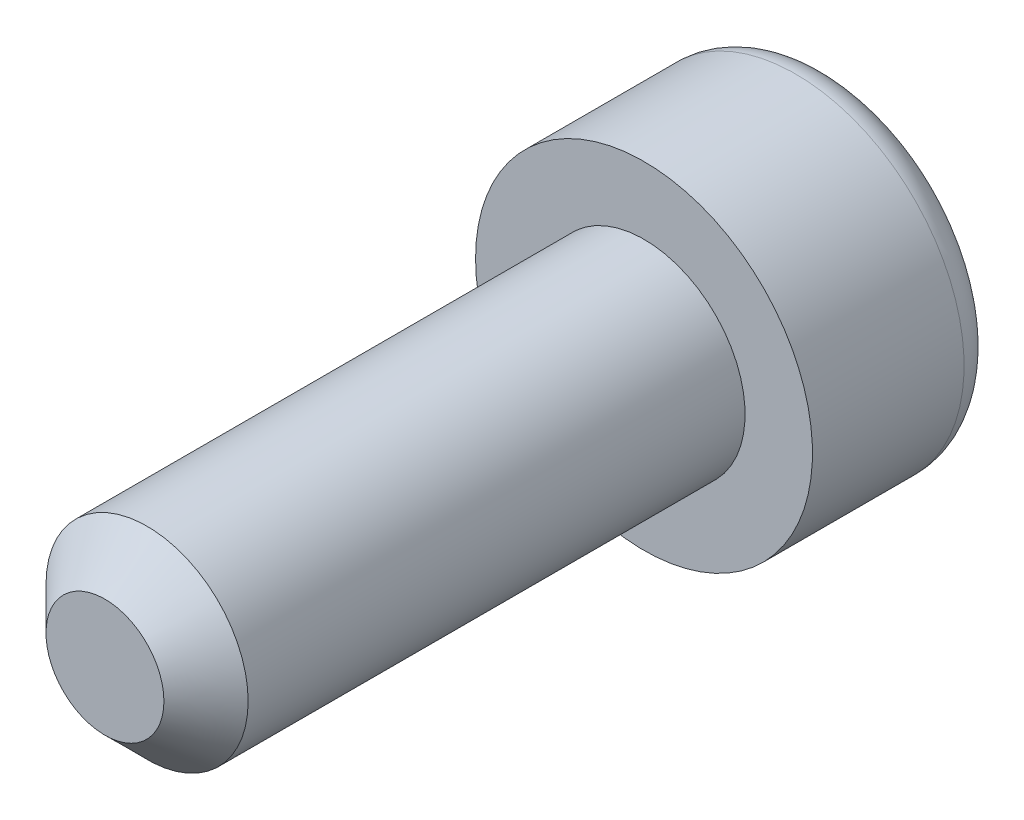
ISO-10303-21;
HEADER;
FILE_DESCRIPTION(('STEP AP214'),'2;1');
FILE_NAME('part.step','',(''),(''),'','','');
FILE_SCHEMA(('AUTOMOTIVE_DESIGN { 1 0 10303 214 1 1 1 1 }'));
ENDSEC;
DATA;
#1=APPLICATION_CONTEXT('core data for automotive mechanical design processes');
#2=APPLICATION_PROTOCOL_DEFINITION('international standard','automotive_design',2000,#1);
#3=PRODUCT_CONTEXT('',#1,'mechanical');
#4=PRODUCT('Part','Part','',(#3));
#5=PRODUCT_RELATED_PRODUCT_CATEGORY('part','',(#4));
#6=PRODUCT_DEFINITION_FORMATION('','',#4);
#7=PRODUCT_DEFINITION_CONTEXT('part definition',#1,'design');
#8=PRODUCT_DEFINITION('design','',#6,#7);
#9=PRODUCT_DEFINITION_SHAPE('','',#8);
#10=(LENGTH_UNIT() NAMED_UNIT(*) SI_UNIT(.MILLI.,.METRE.));
#11=(NAMED_UNIT(*) PLANE_ANGLE_UNIT() SI_UNIT($,.RADIAN.));
#12=(NAMED_UNIT(*) SI_UNIT($,.STERADIAN.) SOLID_ANGLE_UNIT());
#13=UNCERTAINTY_MEASURE_WITH_UNIT(LENGTH_MEASURE(1.E-05),#10,'distance_accuracy_value','');
#14=(GEOMETRIC_REPRESENTATION_CONTEXT(3) GLOBAL_UNCERTAINTY_ASSIGNED_CONTEXT((#13)) GLOBAL_UNIT_ASSIGNED_CONTEXT((#10,
#11,#12)) REPRESENTATION_CONTEXT('',''));
#15=CARTESIAN_POINT('',(0.,0.,0.));
#16=DIRECTION('',(0.,0.,1.));
#17=DIRECTION('',(1.,0.,0.));
#18=AXIS2_PLACEMENT_3D('',#15,#16,#17);
#19=CARTESIAN_POINT('',(0.,0.,16.));
#20=DIRECTION('',(0.,0.,-1.));
#21=DIRECTION('',(-1.,0.,0.));
#22=AXIS2_PLACEMENT_3D('',#19,#20,#21);
#23=CYLINDRICAL_SURFACE('',#22,3.);
#24=CARTESIAN_POINT('',(0.,0.,14.75));
#25=DIRECTION('',(0.,0.,1.));
#26=DIRECTION('',(1.,0.,0.));
#27=AXIS2_PLACEMENT_3D('',#24,#25,#26);
#28=CIRCLE('',#27,3.);
#29=CARTESIAN_POINT('',(3.,0.,14.75));
#30=VERTEX_POINT('',#29);
#31=EDGE_CURVE('E145',#30,#30,#28,.F.);
#32=ORIENTED_EDGE('',*,*,#31,.T.);
#33=EDGE_LOOP('',(#32));
#34=FACE_BOUND('',#33,.T.);
#35=CARTESIAN_POINT('',(0.,0.,0.));
#36=DIRECTION('',(0.,0.,-1.));
#37=DIRECTION('',(-1.,0.,0.));
#38=AXIS2_PLACEMENT_3D('',#35,#36,#37);
#39=CIRCLE('',#38,3.);
#40=CARTESIAN_POINT('',(-3.,0.,0.));
#41=VERTEX_POINT('',#40);
#42=EDGE_CURVE('E139',#41,#41,#39,.T.);
#43=ORIENTED_EDGE('',*,*,#42,.F.);
#44=EDGE_LOOP('',(#43));
#45=FACE_BOUND('',#44,.T.);
#46=ADVANCED_FACE('F28',(#34,#45),#23,.T.);
#47=CARTESIAN_POINT('',(0.,0.,16.));
#48=DIRECTION('',(0.,0.,1.));
#49=DIRECTION('',(1.,0.,0.));
#50=AXIS2_PLACEMENT_3D('',#47,#48,#49);
#51=PLANE('',#50);
#52=CARTESIAN_POINT('',(0.,0.,16.));
#53=DIRECTION('',(0.,0.,1.));
#54=DIRECTION('',(1.,0.,0.));
#55=AXIS2_PLACEMENT_3D('',#52,#53,#54);
#56=CIRCLE('',#55,1.75);
#57=CARTESIAN_POINT('',(1.74999999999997,0.,16.));
#58=VERTEX_POINT('',#57);
#59=EDGE_CURVE('E142',#58,#58,#56,.T.);
#60=ORIENTED_EDGE('',*,*,#59,.T.);
#61=EDGE_LOOP('',(#60));
#62=FACE_BOUND('',#61,.T.);
#63=ADVANCED_FACE('F167',(#62),#51,.T.);
#64=CARTESIAN_POINT('',(0.,0.,0.));
#65=DIRECTION('',(0.,0.,-1.));
#66=DIRECTION('',(-1.,0.,0.));
#67=AXIS2_PLACEMENT_3D('',#64,#65,#66);
#68=PLANE('',#67);
#69=CARTESIAN_POINT('',(0.,0.,0.));
#70=DIRECTION('',(0.,0.,-1.));
#71=DIRECTION('',(-1.,0.,0.));
#72=AXIS2_PLACEMENT_3D('',#69,#70,#71);
#73=CIRCLE('',#72,5.);
#74=CARTESIAN_POINT('',(-5.,0.,0.));
#75=VERTEX_POINT('',#74);
#76=EDGE_CURVE('E130',#75,#75,#73,.T.);
#77=ORIENTED_EDGE('',*,*,#76,.F.);
#78=EDGE_LOOP('',(#77));
#79=FACE_BOUND('',#78,.T.);
#80=ORIENTED_EDGE('',*,*,#42,.T.);
#81=EDGE_LOOP('',(#80));
#82=FACE_BOUND('',#81,.T.);
#83=ADVANCED_FACE('F172',(#79,#82),#68,.F.);
#84=CARTESIAN_POINT('',(0.,0.,-5.50000000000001));
#85=DIRECTION('',(0.,0.,1.));
#86=DIRECTION('',(1.,0.,0.));
#87=AXIS2_PLACEMENT_3D('',#84,#85,#86);
#88=CYLINDRICAL_SURFACE('',#87,5.);
#89=CARTESIAN_POINT('',(0.,0.,-4.5));
#90=DIRECTION('',(0.,0.,-1.));
#91=DIRECTION('',(-1.,0.,0.));
#92=AXIS2_PLACEMENT_3D('',#89,#90,#91);
#93=CIRCLE('',#92,5.);
#94=CARTESIAN_POINT('',(-5.,0.,-4.5));
#95=VERTEX_POINT('',#94);
#96=EDGE_CURVE('E11',#95,#95,#93,.F.);
#97=ORIENTED_EDGE('',*,*,#96,.T.);
#98=EDGE_LOOP('',(#97));
#99=FACE_BOUND('',#98,.T.);
#100=ORIENTED_EDGE('',*,*,#76,.T.);
#101=EDGE_LOOP('',(#100));
#102=FACE_BOUND('',#101,.T.);
#103=ADVANCED_FACE('F179',(#99,#102),#88,.T.);
#104=CARTESIAN_POINT('',(0.,0.,-5.50000000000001));
#105=DIRECTION('',(0.,0.,-1.));
#106=DIRECTION('',(-1.,0.,0.));
#107=AXIS2_PLACEMENT_3D('',#104,#105,#106);
#108=PLANE('',#107);
#109=DIRECTION('',(-0.977909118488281,-0.209030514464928,0.));
#110=VECTOR('',#109,1.);
#111=CARTESIAN_POINT('',(1.54725321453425,-1.71445058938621,-5.50000000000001));
#112=LINE('',#111,#110);
#113=CARTESIAN_POINT('',(1.54725321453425,-1.71445058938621,-5.50000000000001));
#114=VERTEX_POINT('',#113);
#115=CARTESIAN_POINT('',(-0.711131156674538,-2.19718588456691,-5.50000000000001));
#116=VERTEX_POINT('',#115);
#117=EDGE_CURVE('E42',#114,#116,#112,.T.);
#118=ORIENTED_EDGE('',*,*,#117,.F.);
#119=DIRECTION('',(-0.307928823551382,-0.951409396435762,0.));
#120=VECTOR('',#119,1.);
#121=CARTESIAN_POINT('',(2.25838437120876,0.482735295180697,-5.50000000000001));
#122=LINE('',#121,#120);
#123=CARTESIAN_POINT('',(2.25838437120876,0.482735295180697,-5.50000000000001));
#124=VERTEX_POINT('',#123);
#125=EDGE_CURVE('E112',#124,#114,#122,.T.);
#126=ORIENTED_EDGE('',*,*,#125,.F.);
#127=DIRECTION('',(0.669980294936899,-0.742378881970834,0.));
#128=VECTOR('',#127,1.);
#129=CARTESIAN_POINT('',(0.71113115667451,2.19718588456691,-5.50000000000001));
#130=LINE('',#129,#128);
#131=CARTESIAN_POINT('',(0.71113115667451,2.19718588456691,-5.50000000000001));
#132=VERTEX_POINT('',#131);
#133=EDGE_CURVE('E106',#132,#124,#130,.T.);
#134=ORIENTED_EDGE('',*,*,#133,.F.);
#135=DIRECTION('',(0.977909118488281,0.209030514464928,0.));
#136=VECTOR('',#135,1.);
#137=CARTESIAN_POINT('',(-1.54725321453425,1.71445058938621,-5.50000000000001));
#138=LINE('',#137,#136);
#139=CARTESIAN_POINT('',(-1.54725321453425,1.71445058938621,-5.50000000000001));
#140=VERTEX_POINT('',#139);
#141=EDGE_CURVE('E104',#140,#132,#138,.T.);
#142=ORIENTED_EDGE('',*,*,#141,.F.);
#143=DIRECTION('',(0.307928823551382,0.951409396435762,0.));
#144=VECTOR('',#143,1.);
#145=CARTESIAN_POINT('',(-2.25838437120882,-0.482735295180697,-5.50000000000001));
#146=LINE('',#145,#144);
#147=CARTESIAN_POINT('',(-2.25838437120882,-0.482735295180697,-5.50000000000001));
#148=VERTEX_POINT('',#147);
#149=EDGE_CURVE('E85',#148,#140,#146,.T.);
#150=ORIENTED_EDGE('',*,*,#149,.F.);
#151=DIRECTION('',(-0.669980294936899,0.742378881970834,0.));
#152=VECTOR('',#151,1.);
#153=CARTESIAN_POINT('',(-0.711131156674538,-2.19718588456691,-5.50000000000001));
#154=LINE('',#153,#152);
#155=EDGE_CURVE('E96',#116,#148,#154,.T.);
#156=ORIENTED_EDGE('',*,*,#155,.F.);
#157=EDGE_LOOP('',(#118,#126,#134,#142,#150,#156));
#158=FACE_BOUND('',#157,.T.);
#159=CARTESIAN_POINT('',(0.,0.,-5.50000000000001));
#160=DIRECTION('',(0.,0.,-1.));
#161=DIRECTION('',(-1.,0.,0.));
#162=AXIS2_PLACEMENT_3D('',#159,#160,#161);
#163=CIRCLE('',#162,4.);
#164=CARTESIAN_POINT('',(-4.,0.,-5.50000000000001));
#165=VERTEX_POINT('',#164);
#166=EDGE_CURVE('E35',#165,#165,#163,.T.);
#167=ORIENTED_EDGE('',*,*,#166,.T.);
#168=EDGE_LOOP('',(#167));
#169=FACE_BOUND('',#168,.T.);
#170=ADVANCED_FACE('F100',(#158,#169),#108,.T.);
#171=CARTESIAN_POINT('',(0.,0.,16.));
#172=DIRECTION('',(0.,0.,-1.));
#173=DIRECTION('',(-1.,0.,0.));
#174=AXIS2_PLACEMENT_3D('',#171,#172,#173);
#175=CONICAL_SURFACE('',#174,1.75,0.785398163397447);
#176=ORIENTED_EDGE('',*,*,#31,.F.);
#177=EDGE_LOOP('',(#176));
#178=FACE_BOUND('',#177,.T.);
#179=ORIENTED_EDGE('',*,*,#59,.F.);
#180=EDGE_LOOP('',(#179));
#181=FACE_BOUND('',#180,.T.);
#182=ADVANCED_FACE('F153',(#178,#181),#175,.T.);
#183=CARTESIAN_POINT('',(0.,0.,-4.5));
#184=DIRECTION('',(0.,0.,-1.));
#185=DIRECTION('',(-1.,0.,0.));
#186=AXIS2_PLACEMENT_3D('',#183,#184,#185);
#187=TOROIDAL_SURFACE('',#186,4.,1.);
#188=ORIENTED_EDGE('',*,*,#96,.F.);
#189=EDGE_LOOP('',(#188));
#190=FACE_BOUND('',#189,.T.);
#191=ORIENTED_EDGE('',*,*,#166,.F.);
#192=EDGE_LOOP('',(#191));
#193=FACE_BOUND('',#192,.T.);
#194=ADVANCED_FACE('F150',(#190,#193),#187,.T.);
#195=CARTESIAN_POINT('',(1.54725321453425,-1.71445058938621,-1.5));
#196=DIRECTION('',(0.209030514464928,-0.977909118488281,0.));
#197=DIRECTION('',(0.977909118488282,0.209030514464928,0.));
#198=AXIS2_PLACEMENT_3D('',#195,#196,#197);
#199=PLANE('',#198);
#200=ORIENTED_EDGE('',*,*,#117,.T.);
#201=DIRECTION('',(0.,0.,-1.));
#202=VECTOR('',#201,1.);
#203=CARTESIAN_POINT('',(-0.711131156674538,-2.19718588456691,-1.5));
#204=LINE('',#203,#202);
#205=CARTESIAN_POINT('',(-0.711131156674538,-2.19718588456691,-1.5));
#206=VERTEX_POINT('',#205);
#207=EDGE_CURVE('E93',#206,#116,#204,.T.);
#208=ORIENTED_EDGE('',*,*,#207,.F.);
#209=DIRECTION('',(-0.977909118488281,-0.209030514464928,0.));
#210=VECTOR('',#209,1.);
#211=CARTESIAN_POINT('',(1.54725321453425,-1.71445058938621,-1.5));
#212=LINE('',#211,#210);
#213=CARTESIAN_POINT('',(1.54725321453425,-1.71445058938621,-1.5));
#214=VERTEX_POINT('',#213);
#215=EDGE_CURVE('E114',#214,#206,#212,.T.);
#216=ORIENTED_EDGE('',*,*,#215,.F.);
#217=DIRECTION('',(0.,0.,-1.));
#218=VECTOR('',#217,1.);
#219=CARTESIAN_POINT('',(1.54725321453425,-1.71445058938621,-1.5));
#220=LINE('',#219,#218);
#221=EDGE_CURVE('E49',#214,#114,#220,.T.);
#222=ORIENTED_EDGE('',*,*,#221,.T.);
#223=EDGE_LOOP('',(#200,#208,#216,#222));
#224=FACE_BOUND('',#223,.T.);
#225=ADVANCED_FACE('F152',(#224),#199,.F.);
#226=CARTESIAN_POINT('',(2.25838437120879,0.482735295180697,-1.5));
#227=DIRECTION('',(0.951409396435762,-0.307928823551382,0.));
#228=DIRECTION('',(0.307928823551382,0.951409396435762,0.));
#229=AXIS2_PLACEMENT_3D('',#226,#227,#228);
#230=PLANE('',#229);
#231=ORIENTED_EDGE('',*,*,#125,.T.);
#232=ORIENTED_EDGE('',*,*,#221,.F.);
#233=DIRECTION('',(-0.307928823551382,-0.951409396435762,0.));
#234=VECTOR('',#233,1.);
#235=CARTESIAN_POINT('',(2.25838437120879,0.482735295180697,-1.5));
#236=LINE('',#235,#234);
#237=CARTESIAN_POINT('',(2.25838437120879,0.482735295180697,-1.5));
#238=VERTEX_POINT('',#237);
#239=EDGE_CURVE('E126',#238,#214,#236,.T.);
#240=ORIENTED_EDGE('',*,*,#239,.F.);
#241=DIRECTION('',(0.,0.,-1.));
#242=VECTOR('',#241,1.);
#243=CARTESIAN_POINT('',(2.25838437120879,0.482735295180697,-1.5));
#244=LINE('',#243,#242);
#245=EDGE_CURVE('E131',#238,#124,#244,.T.);
#246=ORIENTED_EDGE('',*,*,#245,.T.);
#247=EDGE_LOOP('',(#231,#232,#240,#246));
#248=FACE_BOUND('',#247,.T.);
#249=ADVANCED_FACE('F161',(#248),#230,.F.);
#250=CARTESIAN_POINT('',(0.711131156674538,2.19718588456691,-1.5));
#251=DIRECTION('',(0.742378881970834,0.669980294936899,0.));
#252=DIRECTION('',(-0.669980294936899,0.742378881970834,0.));
#253=AXIS2_PLACEMENT_3D('',#250,#251,#252);
#254=PLANE('',#253);
#255=ORIENTED_EDGE('',*,*,#133,.T.);
#256=ORIENTED_EDGE('',*,*,#245,.F.);
#257=DIRECTION('',(0.669980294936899,-0.742378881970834,0.));
#258=VECTOR('',#257,1.);
#259=CARTESIAN_POINT('',(0.711131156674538,2.19718588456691,-1.5));
#260=LINE('',#259,#258);
#261=CARTESIAN_POINT('',(0.711131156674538,2.19718588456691,-1.5));
#262=VERTEX_POINT('',#261);
#263=EDGE_CURVE('E123',#262,#238,#260,.T.);
#264=ORIENTED_EDGE('',*,*,#263,.F.);
#265=DIRECTION('',(0.,0.,-1.));
#266=VECTOR('',#265,1.);
#267=CARTESIAN_POINT('',(0.711131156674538,2.19718588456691,-1.5));
#268=LINE('',#267,#266);
#269=EDGE_CURVE('E133',#262,#132,#268,.T.);
#270=ORIENTED_EDGE('',*,*,#269,.T.);
#271=EDGE_LOOP('',(#255,#256,#264,#270));
#272=FACE_BOUND('',#271,.T.);
#273=ADVANCED_FACE('F199',(#272),#254,.F.);
#274=CARTESIAN_POINT('',(-1.54725321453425,1.71445058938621,-1.5));
#275=DIRECTION('',(-0.209030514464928,0.977909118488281,0.));
#276=DIRECTION('',(-0.977909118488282,-0.209030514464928,0.));
#277=AXIS2_PLACEMENT_3D('',#274,#275,#276);
#278=PLANE('',#277);
#279=ORIENTED_EDGE('',*,*,#141,.T.);
#280=ORIENTED_EDGE('',*,*,#269,.F.);
#281=DIRECTION('',(0.977909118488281,0.209030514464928,0.));
#282=VECTOR('',#281,1.);
#283=CARTESIAN_POINT('',(-1.54725321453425,1.71445058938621,-1.5));
#284=LINE('',#283,#282);
#285=CARTESIAN_POINT('',(-1.54725321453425,1.71445058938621,-1.5));
#286=VERTEX_POINT('',#285);
#287=EDGE_CURVE('E120',#286,#262,#284,.T.);
#288=ORIENTED_EDGE('',*,*,#287,.F.);
#289=DIRECTION('',(0.,0.,-1.));
#290=VECTOR('',#289,1.);
#291=CARTESIAN_POINT('',(-1.54725321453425,1.71445058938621,-1.5));
#292=LINE('',#291,#290);
#293=EDGE_CURVE('E92',#286,#140,#292,.T.);
#294=ORIENTED_EDGE('',*,*,#293,.T.);
#295=EDGE_LOOP('',(#279,#280,#288,#294));
#296=FACE_BOUND('',#295,.T.);
#297=ADVANCED_FACE('F204',(#296),#278,.F.);
#298=CARTESIAN_POINT('',(-2.25838437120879,-0.482735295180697,-1.5));
#299=DIRECTION('',(-0.951409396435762,0.307928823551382,0.));
#300=DIRECTION('',(-0.307928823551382,-0.951409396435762,0.));
#301=AXIS2_PLACEMENT_3D('',#298,#299,#300);
#302=PLANE('',#301);
#303=ORIENTED_EDGE('',*,*,#149,.T.);
#304=ORIENTED_EDGE('',*,*,#293,.F.);
#305=DIRECTION('',(0.307928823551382,0.951409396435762,0.));
#306=VECTOR('',#305,1.);
#307=CARTESIAN_POINT('',(-2.25838437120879,-0.482735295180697,-1.5));
#308=LINE('',#307,#306);
#309=CARTESIAN_POINT('',(-2.25838437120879,-0.482735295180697,-1.5));
#310=VERTEX_POINT('',#309);
#311=EDGE_CURVE('E88',#310,#286,#308,.T.);
#312=ORIENTED_EDGE('',*,*,#311,.F.);
#313=DIRECTION('',(0.,0.,-1.));
#314=VECTOR('',#313,1.);
#315=CARTESIAN_POINT('',(-2.25838437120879,-0.482735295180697,-1.5));
#316=LINE('',#315,#314);
#317=EDGE_CURVE('E81',#310,#148,#316,.T.);
#318=ORIENTED_EDGE('',*,*,#317,.T.);
#319=EDGE_LOOP('',(#303,#304,#312,#318));
#320=FACE_BOUND('',#319,.T.);
#321=ADVANCED_FACE('F83',(#320),#302,.F.);
#322=CARTESIAN_POINT('',(-0.711131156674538,-2.19718588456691,-1.5));
#323=DIRECTION('',(-0.742378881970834,-0.669980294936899,0.));
#324=DIRECTION('',(0.669980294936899,-0.742378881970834,0.));
#325=AXIS2_PLACEMENT_3D('',#322,#323,#324);
#326=PLANE('',#325);
#327=ORIENTED_EDGE('',*,*,#155,.T.);
#328=ORIENTED_EDGE('',*,*,#317,.F.);
#329=DIRECTION('',(-0.669980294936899,0.742378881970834,0.));
#330=VECTOR('',#329,1.);
#331=CARTESIAN_POINT('',(-0.711131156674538,-2.19718588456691,-1.5));
#332=LINE('',#331,#330);
#333=EDGE_CURVE('E117',#206,#310,#332,.T.);
#334=ORIENTED_EDGE('',*,*,#333,.F.);
#335=ORIENTED_EDGE('',*,*,#207,.T.);
#336=EDGE_LOOP('',(#327,#328,#334,#335));
#337=FACE_BOUND('',#336,.T.);
#338=ADVANCED_FACE('F97',(#337),#326,.F.);
#339=CARTESIAN_POINT('',(1.54725321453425,-1.71445058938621,-1.5));
#340=DIRECTION('',(0.,0.,1.));
#341=DIRECTION('',(1.,0.,0.));
#342=AXIS2_PLACEMENT_3D('',#339,#340,#341);
#343=PLANE('',#342);
#344=ORIENTED_EDGE('',*,*,#215,.T.);
#345=ORIENTED_EDGE('',*,*,#333,.T.);
#346=ORIENTED_EDGE('',*,*,#311,.T.);
#347=ORIENTED_EDGE('',*,*,#287,.T.);
#348=ORIENTED_EDGE('',*,*,#263,.T.);
#349=ORIENTED_EDGE('',*,*,#239,.T.);
#350=EDGE_LOOP('',(#344,#345,#346,#347,#348,#349));
#351=FACE_BOUND('',#350,.T.);
#352=ADVANCED_FACE('F219',(#351),#343,.F.);
#353=CLOSED_SHELL('',(#46,#63,#83,#103,#170,#182,#194,#225,#249,#273,#297,#321,#338,#352));
#354=MANIFOLD_SOLID_BREP('B2',#353);
#355=ADVANCED_BREP_SHAPE_REPRESENTATION('',(#18,#354),#14);
#356=SHAPE_DEFINITION_REPRESENTATION(#9,#355);
ENDSEC;
END-ISO-10303-21;
